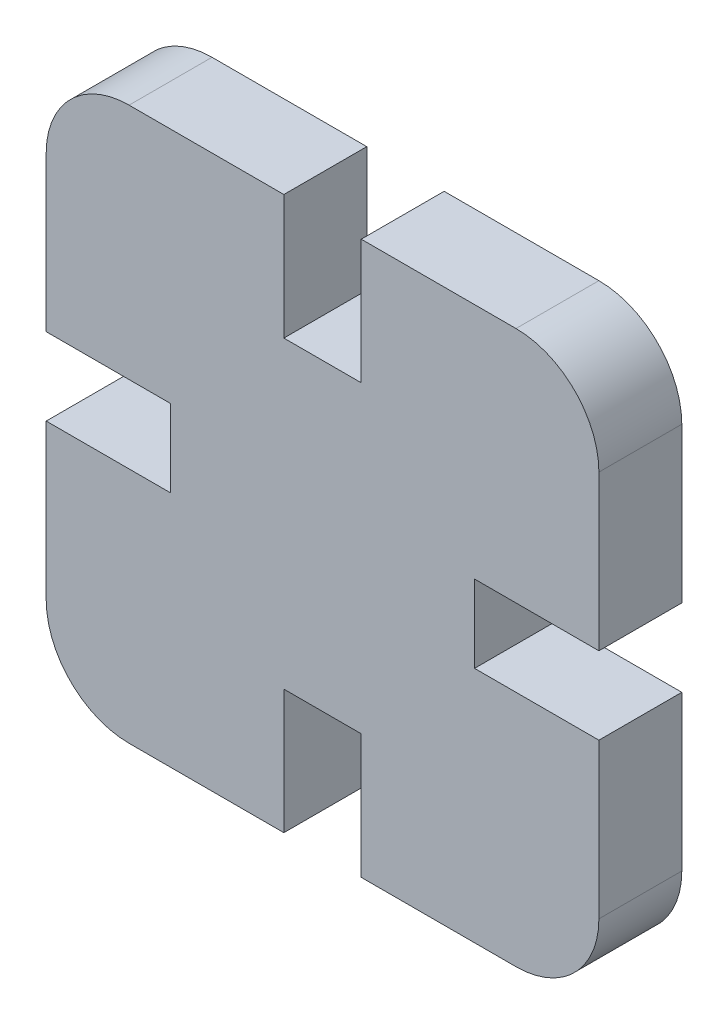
from build123d import *

# Parameters (mm, degrees)
BOSS_EXTRU_1_DEPTH = 3


with BuildPart() as part:
    # Esquisse1 → Boss.-Extru.1 (new body)
    with BuildSketch(Plane.XY):
        with BuildLine():
            Line((-7, -10), (-1.4, -10))
            Line((-1.4, -10), (-1.4, -5.5))
            Line((-1.4, -5.5), (1.4, -5.5))
            Line((1.4, -5.5), (1.4, -10))
            Line((1.4, -10), (7, -10))
            ThreePointArc((7, -10), (9.121320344, -9.121320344), (10, -7))
            Line((10, -7), (10, -1.4))
            Line((10, -1.4), (5.5, -1.4))
            Line((5.5, -1.4), (5.5, 1.4))
            Line((5.5, 1.4), (10, 1.4))
            Line((10, 1.4), (10, 7))
            ThreePointArc((10, 7), (9.121320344, 9.121320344), (7, 10))
            Line((7, 10), (1.4, 10))
            Line((1.4, 10), (1.4, 5.5))
            Line((1.4, 5.5), (-1.4, 5.5))
            Line((-1.4, 5.5), (-1.4, 10))
            Line((-1.4, 10), (-7, 10))
            ThreePointArc((-7, 10), (-9.121320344, 9.121320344), (-10, 7))
            Line((-10, 7), (-10, 1.4))
            Line((-10, 1.4), (-5.5, 1.4))
            Line((-5.5, 1.4), (-5.5, -1.4))
            Line((-5.5, -1.4), (-10, -1.4))
            Line((-10, -1.4), (-10, -7))
            ThreePointArc((-10, -7), (-9.121320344, -9.121320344), (-7, -10))
        make_face()
    extrude(amount=BOSS_EXTRU_1_DEPTH)


solid = part.part
